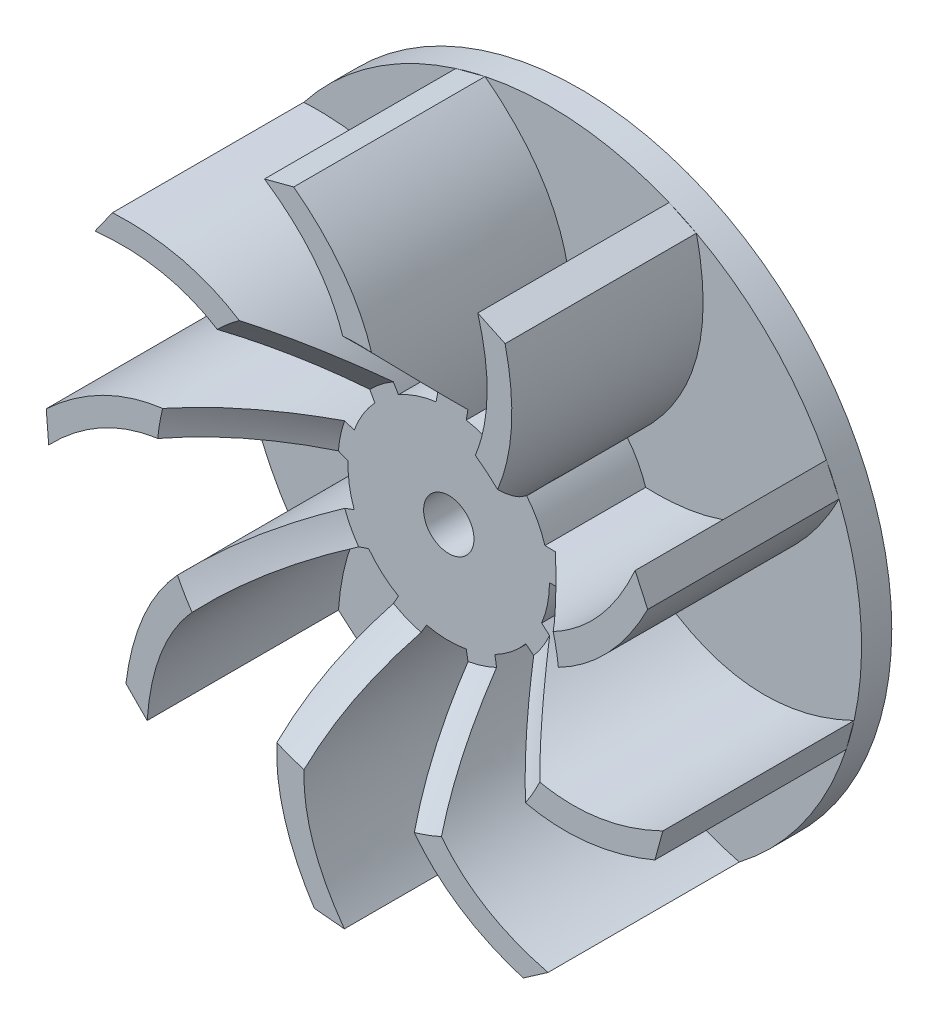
from build123d import *

# Parameters (mm, degrees)
SKETCH_1_R          = 31
EXTRUDE_1_DEPTH     = 3
SKETCH_2_R          = 10
EXTRUDE_2_DEPTH     = 19
SKETCH_3_R          = 6
CUT_EXTRUDE_1_DEPTH = 50.050993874
EXTRUDE_5_DEPTH     = 19
SKETCH_5_R          = 20
CUT_EXTRUDE_2_DEPTH = 9
CUT_EXTRUDE_2_DRAFT = -45
SKETCH_6_R          = 6.5
EXTRUDE_6_DEPTH     = 13
SKETCH_7_R          = 5
CUT_EXTRUDE_3_DEPTH = 5
SKETCH_8_R          = 2.5
CUT_EXTRUDE_4_DEPTH = 50.050994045


with BuildPart() as part:
    # Sketch 1 → Extrude 1 (new body)
    with BuildSketch(Plane.XY):
        Circle(SKETCH_1_R)
    extrude(amount=EXTRUDE_1_DEPTH)

    # Sketch 2 → Extrude 2 (add)
    with BuildSketch(Plane.XY.offset(3)):
        Circle(SKETCH_2_R)
    extrude(amount=EXTRUDE_2_DEPTH)

    # Sketch 3 → Cut-Extrude 1 (cut, through all)
    with BuildSketch(Plane.XY.offset(22)):
        Circle(SKETCH_3_R)
    extrude(amount=-CUT_EXTRUDE_1_DEPTH, mode=Mode.SUBTRACT)

    # Sketch 4 → Extrude 5 (add)
    with BuildSketch(Plane.XY.offset(3)):
        with BuildLine():
            Line((28.759245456, 11.571767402), (27.506040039, 14.29747395))
            add(Edge.make_bspline(
                [(9.55, 2.96605799), (22.255159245, 2.515037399), (27.506040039, 14.29747395)],
                knots=[0, 0, 0, 1, 1, 1], degree=2))
            Line((9.55, 2.96605799), (10, 0))
            add(Edge.make_bspline(
                [(10, 0), (22.751036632, -0.13914535), (28.759245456, 11.571767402)],
                knots=[0, 0, 0, 1, 1, 1], degree=2))
        make_face()
        with BuildLine():
            Line((29.469048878, -9.621598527), (30.261088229, -6.728041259))
            add(Edge.make_bspline(
                [(9.222269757, -3.866489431), (18.665075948, -12.378710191), (30.261088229, -6.728041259)],
                knots=[0, 0, 0, 1, 1, 1], degree=2))
            Line((9.222269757, -3.866489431), (7.660444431, -6.427876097))
            add(Edge.make_bspline(
                [(7.660444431, -6.427876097), (17.33886428, -14.730675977), (29.469048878, -9.621598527)],
                knots=[0, 0, 0, 1, 1, 1], degree=2))
        make_face()
        with BuildLine():
            Line((16.389956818, -26.312911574), (18.856636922, -24.605431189))
            add(Edge.make_bspline(
                [(4.579337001, -8.889863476), (6.341396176, -21.480321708), (18.856636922, -24.605431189)],
                knots=[0, 0, 0, 1, 1, 1], degree=2))
            Line((4.579337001, -8.889863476), (1.736481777, -9.84807753))
            add(Edge.make_bspline(
                [(1.736481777, -9.84807753), (3.813644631, -22.4295596), (16.389956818, -26.312911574)],
                knots=[0, 0, 0, 1, 1, 1], degree=2))
        make_face()
        with BuildLine():
            Line((-4.358178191, -30.69212086), (-1.371044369, -30.969666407))
            add(Edge.make_bspline(
                [(-2.206318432, -9.753571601), (-8.949493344, -20.531051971), (-1.371044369, -30.969666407)],
                knots=[0, 0, 0, 1, 1, 1], degree=2))
            Line((-2.206318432, -9.753571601), (-5, -8.660254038))
            add(Edge.make_bspline(
                [(-5, -8.660254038), (-11.496021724, -19.63340301), (-4.358178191, -30.69212086)],
                knots=[0, 0, 0, 1, 1, 1], degree=2))
        make_face()
        with BuildLine():
            Line((-23.067073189, -20.71014569), (-20.957198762, -22.842850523))
            add(Edge.make_bspline(
                [(-7.95961295, -6.053475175), (-20.052815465, -9.975074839), (-20.957198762, -22.842850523)],
                knots=[0, 0, 0, 1, 1, 1], degree=2))
            Line((-7.95961295, -6.053475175), (-9.396926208, -3.420201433))
            add(Edge.make_bspline(
                [(-9.396926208, -3.420201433), (-21.426571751, -7.650558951), (-23.067073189, -20.71014569)],
                knots=[0, 0, 0, 1, 1, 1], degree=2))
        make_face()
        with BuildLine():
            Line((-30.98262828, -1.037663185), (-30.737246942, -4.02761101))
            add(Edge.make_bspline(
                [(-9.988516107, 0.479109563), (-21.773202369, 5.24835067), (-30.737246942, -4.02761101)],
                knots=[0, 0, 0, 1, 1, 1], degree=2))
            Line((-9.988516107, 0.479109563), (-9.396926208, 3.420201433))
            add(Edge.make_bspline(
                [(-9.396926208, 3.420201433), (-21.331390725, 7.912066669), (-30.98262828, -1.037663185)],
                knots=[0, 0, 0, 1, 1, 1], degree=2))
        make_face()
        with BuildLine():
            Line((-24.401067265, 19.120353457), (-26.13499567, 16.672192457))
            add(Edge.make_bspline(
                [(-7.343681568, 6.787513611), (-13.305665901, 18.016014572), (-26.13499567, 16.672192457)],
                knots=[0, 0, 0, 1, 1, 1], degree=2))
            Line((-7.343681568, 6.787513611), (-5, 8.660254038))
            add(Edge.make_bspline(
                [(-5, 8.660254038), (-11.255014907, 19.772548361), (-24.401067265, 19.120353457)],
                knots=[0, 0, 0, 1, 1, 1], degree=2))
        make_face()
        with BuildLine():
            Line((-6.401975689, 30.331744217), (-9.303889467, 29.570891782))
            add(Edge.make_bspline(
                [(-1.262656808, 9.919964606), (1.387739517, 22.35378503), (-9.303889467, 29.570891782)],
                knots=[0, 0, 0, 1, 1, 1], degree=2))
            Line((-1.262656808, 9.919964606), (1.736481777, 9.84807753))
            add(Edge.make_bspline(
                [(1.736481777, 9.84807753), (4.087707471, 22.381234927), (-6.401975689, 30.331744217)],
                knots=[0, 0, 0, 1, 1, 1], degree=2))
        make_face()
        with BuildLine():
            Line((14.592671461, 27.350574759), (11.880610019, 28.633042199))
            add(Edge.make_bspline(
                [(5.409179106, 8.410753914), (15.431806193, 16.231971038), (11.880610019, 28.633042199)],
                knots=[0, 0, 0, 1, 1, 1], degree=2))
            Line((5.409179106, 8.410753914), (7.660444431, 6.427876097))
            add(Edge.make_bspline(
                [(7.660444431, 6.427876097), (17.517746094, 14.517492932), (14.592671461, 27.350574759)],
                knots=[0, 0, 0, 1, 1, 1], degree=2))
        make_face()
    extrude(amount=EXTRUDE_5_DEPTH)


with BuildPart() as cut_extrude_2_tool:
    # Sketch 5 → Cut-Extrude 2 (with draft: the straight prism first)
    with BuildSketch(Plane.XY.offset(22)):
        Circle(SKETCH_5_R)
    extrude(amount=-CUT_EXTRUDE_2_DEPTH)
    # Cut-Extrude 2: the draft: its side faces are tilted about the plane it starts from
    cut_extrude_2_sides = [cut_extrude_2_tool.faces().sort_by_distance(p)[0] for p in [
        (-20, 0, 17.5),
    ]]
    draft(cut_extrude_2_sides, Plane.XY.offset(22), CUT_EXTRUDE_2_DRAFT)


with BuildPart() as part_1:
    add(part.part)

    # Cut-Extrude 2: cut by cut_extrude_2_tool
    add(cut_extrude_2_tool.part, mode=Mode.SUBTRACT)

    # Sketch 6 → Extrude 6 (add)
    with BuildSketch(Plane(origin=(0, 0, 0), x_dir=(-1, 0, 0), z_dir=(0, 0, -1))):
        Circle(SKETCH_6_R)
    extrude(amount=-EXTRUDE_6_DEPTH)

    # Sketch 7 → Cut-Extrude 3 (cut)
    with BuildSketch(Plane(origin=(0, 0, 0), x_dir=(-1, 0, 0), z_dir=(0, 0, -1))):
        Circle(SKETCH_7_R)
    extrude(amount=-CUT_EXTRUDE_3_DEPTH, mode=Mode.SUBTRACT)

    # Sketch 8 → Cut-Extrude 4 (cut, through all)
    with BuildSketch(Plane(origin=(0, 0, 0), x_dir=(-1, 0, 0), z_dir=(0, 0, -1))):
        Circle(SKETCH_8_R)
    extrude(amount=-CUT_EXTRUDE_4_DEPTH, mode=Mode.SUBTRACT)


solid = part_1.part
